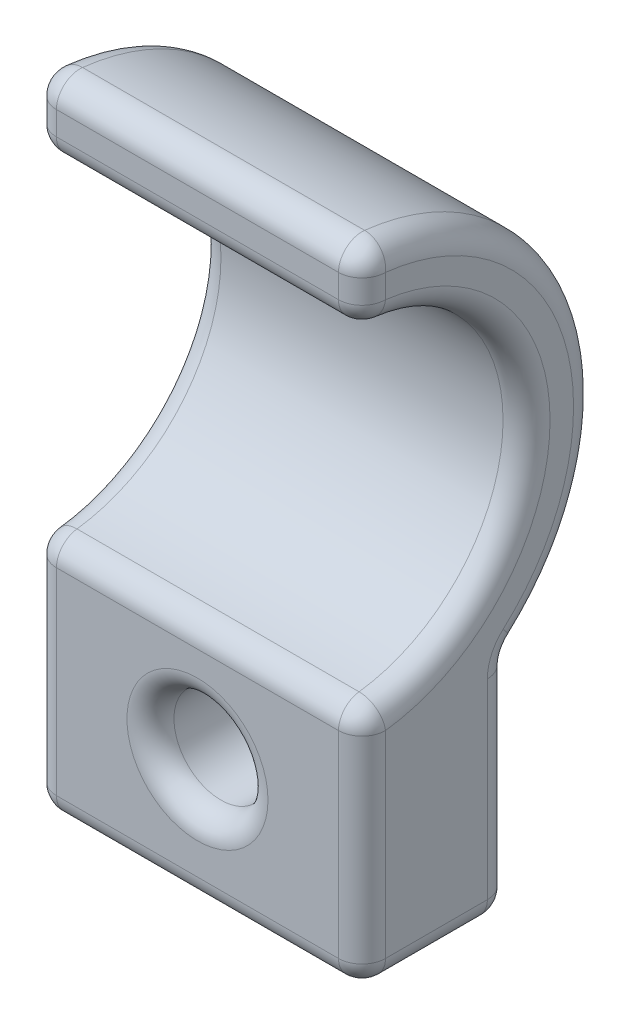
from build123d import *

# Parameters (mm, degrees)
SALIENTE_EXTRUIR1_DEPTH = 42
CROQUIS2_R              = 6
CORTAR_EXTRUIR1_DEPTH   = 97.89169211
REDONDEO1_R             = 3


with BuildPart() as part:
    # Croquis1 → Saliente-Extruir1 (new body)
    with BuildSketch(Plane(origin=(0, 0, 0), x_dir=(0, 0, -1), z_dir=(1, 0, 0))):
        with BuildLine():
            Line((0, 0), (19, 0))
            Line((19, 0), (19, 28.783626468))
            ThreePointArc((19, 28.783626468), (28.253240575, 62.08733845), (0, 82))
            Line((0, 82), (0, 73))
            ThreePointArc((0, 73), (21, 52), (0, 31))
            Line((0, 31), (0, 0))
        make_face()
    extrude(amount=-SALIENTE_EXTRUIR1_DEPTH)

    # Croquis2 → Cortar-Extruir1 (cut, through all)
    with BuildSketch(Plane.XY):
        with Locations((-21, 16)):
            Circle(CROQUIS2_R)
    extrude(amount=-CORTAR_EXTRUIR1_DEPTH, mode=Mode.SUBTRACT)

    # Redondeo1
    redondeo1_edges = [part.edges().sort_by_distance(p)[0] for p in [
        (-42, 14.391813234, -19),
        (-21, 31, 0),
        (-21, 73, 0),
        (-21, 82, 0),
        (-21, 28.783626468, -19),
        (-21, 0, -19),
        (-21, 0, 0),
        (-42, 62.08733845, -28.253240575),
        (-42, 77.5, 0),
        (-42, 52, -21),
        (-27, 16, -19),
        (-27, 16, 0),
        (-42, 15.5, 0),
        (0, 52, -21),
        (0, 77.5, 0),
        (0, 62.08733845, -28.253240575),
        (-42, 0, -9.5),
        (0, 14.391813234, -19),
        (0, 0, -9.5),
        (0, 15.5, 0),
    ]]
    fillet(redondeo1_edges, radius=REDONDEO1_R)


solid = part.part
